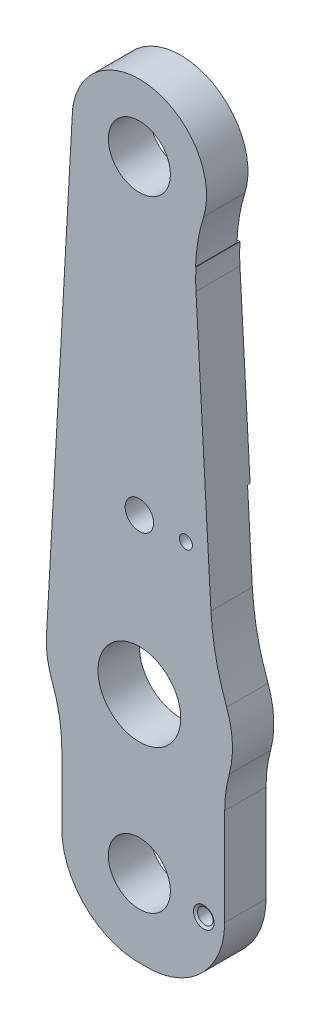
ISO-10303-21;
HEADER;
FILE_DESCRIPTION(('STEP AP214'),'2;1');
FILE_NAME('part.step','',(''),(''),'','','');
FILE_SCHEMA(('AUTOMOTIVE_DESIGN { 1 0 10303 214 1 1 1 1 }'));
ENDSEC;
DATA;
#1=APPLICATION_CONTEXT('core data for automotive mechanical design processes');
#2=APPLICATION_PROTOCOL_DEFINITION('international standard','automotive_design',2000,#1);
#3=PRODUCT_CONTEXT('',#1,'mechanical');
#4=PRODUCT('Part','Part','',(#3));
#5=PRODUCT_RELATED_PRODUCT_CATEGORY('part','',(#4));
#6=PRODUCT_DEFINITION_FORMATION('','',#4);
#7=PRODUCT_DEFINITION_CONTEXT('part definition',#1,'design');
#8=PRODUCT_DEFINITION('design','',#6,#7);
#9=PRODUCT_DEFINITION_SHAPE('','',#8);
#10=(LENGTH_UNIT() NAMED_UNIT(*) SI_UNIT(.MILLI.,.METRE.));
#11=(NAMED_UNIT(*) PLANE_ANGLE_UNIT() SI_UNIT($,.RADIAN.));
#12=(NAMED_UNIT(*) SI_UNIT($,.STERADIAN.) SOLID_ANGLE_UNIT());
#13=UNCERTAINTY_MEASURE_WITH_UNIT(LENGTH_MEASURE(1.E-05),#10,'distance_accuracy_value','');
#14=(GEOMETRIC_REPRESENTATION_CONTEXT(3) GLOBAL_UNCERTAINTY_ASSIGNED_CONTEXT((#13)) GLOBAL_UNIT_ASSIGNED_CONTEXT((#10,
#11,#12)) REPRESENTATION_CONTEXT('',''));
#15=CARTESIAN_POINT('',(0.,0.,0.));
#16=DIRECTION('',(0.,0.,1.));
#17=DIRECTION('',(1.,0.,0.));
#18=AXIS2_PLACEMENT_3D('',#15,#16,#17);
#19=CARTESIAN_POINT('',(0.,-180.,0.));
#20=DIRECTION('',(0.,0.,1.));
#21=DIRECTION('',(1.,0.,0.));
#22=AXIS2_PLACEMENT_3D('',#19,#20,#21);
#23=PLANE('',#22);
#24=CARTESIAN_POINT('',(18.,-120.,0.));
#25=DIRECTION('',(0.,0.,1.));
#26=DIRECTION('',(1.,0.,0.));
#27=AXIS2_PLACEMENT_3D('',#24,#25,#26);
#28=CIRCLE('',#27,2.5);
#29=CARTESIAN_POINT('',(20.5,-120.,0.));
#30=VERTEX_POINT('',#29);
#31=EDGE_CURVE('E421',#30,#30,#28,.T.);
#32=ORIENTED_EDGE('',*,*,#31,.T.);
#33=EDGE_LOOP('',(#32));
#34=FACE_BOUND('',#33,.T.);
#35=CARTESIAN_POINT('',(0.,-180.,0.));
#36=DIRECTION('',(0.,0.,1.));
#37=DIRECTION('',(1.,0.,0.));
#38=AXIS2_PLACEMENT_3D('',#35,#36,#37);
#39=CIRCLE('',#38,16.);
#40=CARTESIAN_POINT('',(16.,-180.,0.));
#41=VERTEX_POINT('',#40);
#42=EDGE_CURVE('E416',#41,#41,#39,.T.);
#43=ORIENTED_EDGE('',*,*,#42,.T.);
#44=EDGE_LOOP('',(#43));
#45=FACE_BOUND('',#44,.T.);
#46=CARTESIAN_POINT('',(0.,-120.,0.));
#47=DIRECTION('',(0.,0.,1.));
#48=DIRECTION('',(1.,0.,0.));
#49=AXIS2_PLACEMENT_3D('',#46,#47,#48);
#50=CIRCLE('',#49,5.5);
#51=CARTESIAN_POINT('',(5.5,-120.,0.));
#52=VERTEX_POINT('',#51);
#53=EDGE_CURVE('E373',#52,#52,#50,.T.);
#54=ORIENTED_EDGE('',*,*,#53,.T.);
#55=EDGE_LOOP('',(#54));
#56=FACE_BOUND('',#55,.T.);
#57=CARTESIAN_POINT('',(0.,-240.,0.));
#58=DIRECTION('',(0.,0.,1.));
#59=DIRECTION('',(1.,0.,0.));
#60=AXIS2_PLACEMENT_3D('',#57,#58,#59);
#61=CIRCLE('',#60,12.);
#62=CARTESIAN_POINT('',(12.,-240.,0.));
#63=VERTEX_POINT('',#62);
#64=EDGE_CURVE('E218',#63,#63,#61,.T.);
#65=ORIENTED_EDGE('',*,*,#64,.T.);
#66=EDGE_LOOP('',(#65));
#67=FACE_BOUND('',#66,.T.);
#68=DIRECTION('',(-0.0554700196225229,-0.998460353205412,0.));
#69=VECTOR('',#68,1.);
#70=CARTESIAN_POINT('',(-26.,0.,0.));
#71=LINE('',#70,#69);
#72=CARTESIAN_POINT('',(-31.8333333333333,-105.,0.));
#73=VERTEX_POINT('',#72);
#74=CARTESIAN_POINT('',(-35.7784615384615,-176.012307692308,0.));
#75=VERTEX_POINT('',#74);
#76=EDGE_CURVE('E247',#73,#75,#71,.T.);
#77=ORIENTED_EDGE('',*,*,#76,.F.);
#78=DIRECTION('',(1.,0.,0.));
#79=VECTOR('',#78,1.);
#80=CARTESIAN_POINT('',(0.,-105.,0.));
#81=LINE('',#80,#79);
#82=CARTESIAN_POINT('',(25.8333333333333,-105.,0.));
#83=VERTEX_POINT('',#82);
#84=EDGE_CURVE('E370',#73,#83,#81,.T.);
#85=ORIENTED_EDGE('',*,*,#84,.T.);
#86=DIRECTION('',(-0.0554700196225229,0.998460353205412,0.));
#87=VECTOR('',#86,1.);
#88=CARTESIAN_POINT('',(21.7961207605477,-32.3301736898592,0.));
#89=LINE('',#88,#87);
#90=CARTESIAN_POINT('',(27.6833465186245,-138.30023733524,0.));
#91=VERTEX_POINT('',#90);
#92=EDGE_CURVE('E240',#91,#83,#89,.T.);
#93=ORIENTED_EDGE('',*,*,#92,.F.);
#94=CARTESIAN_POINT('',(127.529381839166,-132.753235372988,0.));
#95=DIRECTION('',(0.,0.,-1.));
#96=DIRECTION('',(1.,0.,0.));
#97=AXIS2_PLACEMENT_3D('',#94,#95,#96);
#98=CIRCLE('',#97,100.);
#99=CARTESIAN_POINT('',(33.7577775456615,-167.493503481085,0.));
#100=VERTEX_POINT('',#99);
#101=EDGE_CURVE('E238',#100,#91,#98,.T.);
#102=ORIENTED_EDGE('',*,*,#101,.F.);
#103=CARTESIAN_POINT('',(0.,-180.,0.));
#104=DIRECTION('',(0.,0.,1.));
#105=DIRECTION('',(1.,0.,0.));
#106=AXIS2_PLACEMENT_3D('',#103,#104,#105);
#107=CIRCLE('',#106,36.);
#108=CARTESIAN_POINT('',(34.7441860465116,-189.425578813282,0.));
#109=VERTEX_POINT('',#108);
#110=EDGE_CURVE('E236',#109,#100,#107,.T.);
#111=ORIENTED_EDGE('',*,*,#110,.F.);
#112=CARTESIAN_POINT('',(83.,-202.516660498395,0.));
#113=DIRECTION('',(0.,0.,-1.));
#114=DIRECTION('',(-1.,0.,0.));
#115=AXIS2_PLACEMENT_3D('',#112,#113,#114);
#116=CIRCLE('',#115,50.);
#117=CARTESIAN_POINT('',(33.,-202.516660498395,0.));
#118=VERTEX_POINT('',#117);
#119=EDGE_CURVE('E234',#118,#109,#116,.T.);
#120=ORIENTED_EDGE('',*,*,#119,.F.);
#121=DIRECTION('',(0.,1.,0.));
#122=VECTOR('',#121,1.);
#123=CARTESIAN_POINT('',(33.,-240.,0.));
#124=LINE('',#123,#122);
#125=CARTESIAN_POINT('',(33.,-240.,0.));
#126=VERTEX_POINT('',#125);
#127=EDGE_CURVE('E232',#126,#118,#124,.T.);
#128=ORIENTED_EDGE('',*,*,#127,.F.);
#129=CARTESIAN_POINT('',(3.00000000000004,-240.,0.));
#130=DIRECTION('',(0.,0.,1.));
#131=DIRECTION('',(1.,0.,0.));
#132=AXIS2_PLACEMENT_3D('',#129,#130,#131);
#133=CIRCLE('',#132,30.);
#134=CARTESIAN_POINT('',(1.50000000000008,-269.962476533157,0.));
#135=VERTEX_POINT('',#134);
#136=EDGE_CURVE('E230',#135,#126,#133,.T.);
#137=ORIENTED_EDGE('',*,*,#136,.F.);
#138=CARTESIAN_POINT('',(0.,-240.,0.));
#139=DIRECTION('',(0.,0.,1.));
#140=DIRECTION('',(1.,0.,0.));
#141=AXIS2_PLACEMENT_3D('',#138,#139,#140);
#142=CIRCLE('',#141,29.9999999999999);
#143=CARTESIAN_POINT('',(-29.9999999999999,-240.,0.));
#144=VERTEX_POINT('',#143);
#145=EDGE_CURVE('E228',#144,#135,#142,.T.);
#146=ORIENTED_EDGE('',*,*,#145,.F.);
#147=DIRECTION('',(0.,-1.,0.));
#148=VECTOR('',#147,1.);
#149=CARTESIAN_POINT('',(-30.,-240.,0.));
#150=LINE('',#149,#148);
#151=CARTESIAN_POINT('',(-30.,-213.40658617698,0.));
#152=VERTEX_POINT('',#151);
#153=EDGE_CURVE('E226',#152,#144,#150,.T.);
#154=ORIENTED_EDGE('',*,*,#153,.F.);
#155=CARTESIAN_POINT('',(-90.,-213.40658617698,0.));
#156=DIRECTION('',(0.,0.,-1.));
#157=DIRECTION('',(-1.,0.,0.));
#158=AXIS2_PLACEMENT_3D('',#155,#156,#157);
#159=CIRCLE('',#158,60.);
#160=CARTESIAN_POINT('',(-33.75,-192.527469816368,0.));
#161=VERTEX_POINT('',#160);
#162=EDGE_CURVE('E224',#161,#152,#159,.T.);
#163=ORIENTED_EDGE('',*,*,#162,.F.);
#164=CARTESIAN_POINT('',(0.,-180.,0.));
#165=DIRECTION('',(0.,0.,1.));
#166=DIRECTION('',(1.,0.,0.));
#167=AXIS2_PLACEMENT_3D('',#164,#165,#166);
#168=CIRCLE('',#167,36.);
#169=EDGE_CURVE('E215',#75,#161,#168,.T.);
#170=ORIENTED_EDGE('',*,*,#169,.F.);
#171=EDGE_LOOP('',(#77,#85,#93,#102,#111,#120,#128,#137,#146,#154,#163,#170));
#172=FACE_BOUND('',#171,.T.);
#173=ADVANCED_FACE('F34',(#34,#45,#56,#67,#172),#23,.F.);
#174=CARTESIAN_POINT('',(0.,-180.,16.));
#175=DIRECTION('',(0.,0.,1.));
#176=DIRECTION('',(1.,0.,0.));
#177=AXIS2_PLACEMENT_3D('',#174,#175,#176);
#178=PLANE('',#177);
#179=CARTESIAN_POINT('',(18.,-120.,16.));
#180=DIRECTION('',(0.,0.,1.));
#181=DIRECTION('',(1.,0.,0.));
#182=AXIS2_PLACEMENT_3D('',#179,#180,#181);
#183=CIRCLE('',#182,2.5);
#184=CARTESIAN_POINT('',(20.5,-120.,16.));
#185=VERTEX_POINT('',#184);
#186=EDGE_CURVE('E425',#185,#185,#183,.T.);
#187=ORIENTED_EDGE('',*,*,#186,.F.);
#188=EDGE_LOOP('',(#187));
#189=FACE_BOUND('',#188,.T.);
#190=CARTESIAN_POINT('',(0.,-180.,16.));
#191=DIRECTION('',(0.,0.,1.));
#192=DIRECTION('',(1.,0.,0.));
#193=AXIS2_PLACEMENT_3D('',#190,#191,#192);
#194=CIRCLE('',#193,16.);
#195=CARTESIAN_POINT('',(16.,-180.,16.));
#196=VERTEX_POINT('',#195);
#197=EDGE_CURVE('E418',#196,#196,#194,.T.);
#198=ORIENTED_EDGE('',*,*,#197,.F.);
#199=EDGE_LOOP('',(#198));
#200=FACE_BOUND('',#199,.T.);
#201=CARTESIAN_POINT('',(24.9048674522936,-242.178893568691,16.));
#202=DIRECTION('',(0.,0.,1.));
#203=DIRECTION('',(1.,0.,0.));
#204=AXIS2_PLACEMENT_3D('',#201,#202,#203);
#205=CIRCLE('',#204,4.00000000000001);
#206=CARTESIAN_POINT('',(28.9048674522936,-242.178893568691,16.));
#207=VERTEX_POINT('',#206);
#208=EDGE_CURVE('E11',#207,#207,#205,.F.);
#209=ORIENTED_EDGE('',*,*,#208,.T.);
#210=EDGE_LOOP('',(#209));
#211=FACE_BOUND('',#210,.T.);
#212=DIRECTION('',(-0.0554700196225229,-0.998460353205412,0.));
#213=VECTOR('',#212,1.);
#214=CARTESIAN_POINT('',(-26.,0.,16.));
#215=LINE('',#214,#213);
#216=CARTESIAN_POINT('',(-26.,0.,16.));
#217=VERTEX_POINT('',#216);
#218=CARTESIAN_POINT('',(-35.7784615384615,-176.012307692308,16.));
#219=VERTEX_POINT('',#218);
#220=EDGE_CURVE('E277',#217,#219,#215,.T.);
#221=ORIENTED_EDGE('',*,*,#220,.T.);
#222=CARTESIAN_POINT('',(0.,-180.,16.));
#223=DIRECTION('',(0.,0.,1.));
#224=DIRECTION('',(1.,0.,0.));
#225=AXIS2_PLACEMENT_3D('',#222,#223,#224);
#226=CIRCLE('',#225,36.);
#227=CARTESIAN_POINT('',(-33.75,-192.527469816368,16.));
#228=VERTEX_POINT('',#227);
#229=EDGE_CURVE('E251',#219,#228,#226,.T.);
#230=ORIENTED_EDGE('',*,*,#229,.T.);
#231=CARTESIAN_POINT('',(-90.,-213.40658617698,16.));
#232=DIRECTION('',(0.,0.,-1.));
#233=DIRECTION('',(-1.,0.,0.));
#234=AXIS2_PLACEMENT_3D('',#231,#232,#233);
#235=CIRCLE('',#234,60.);
#236=CARTESIAN_POINT('',(-30.,-213.40658617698,16.));
#237=VERTEX_POINT('',#236);
#238=EDGE_CURVE('E254',#228,#237,#235,.T.);
#239=ORIENTED_EDGE('',*,*,#238,.T.);
#240=DIRECTION('',(0.,-1.,0.));
#241=VECTOR('',#240,1.);
#242=CARTESIAN_POINT('',(-30.,-240.,16.));
#243=LINE('',#242,#241);
#244=CARTESIAN_POINT('',(-29.9999999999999,-240.,16.));
#245=VERTEX_POINT('',#244);
#246=EDGE_CURVE('E256',#237,#245,#243,.T.);
#247=ORIENTED_EDGE('',*,*,#246,.T.);
#248=CARTESIAN_POINT('',(0.,-240.,16.));
#249=DIRECTION('',(0.,0.,1.));
#250=DIRECTION('',(1.,0.,0.));
#251=AXIS2_PLACEMENT_3D('',#248,#249,#250);
#252=CIRCLE('',#251,29.9999999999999);
#253=CARTESIAN_POINT('',(1.50000000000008,-269.962476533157,16.));
#254=VERTEX_POINT('',#253);
#255=EDGE_CURVE('E258',#245,#254,#252,.T.);
#256=ORIENTED_EDGE('',*,*,#255,.T.);
#257=CARTESIAN_POINT('',(3.00000000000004,-240.,16.));
#258=DIRECTION('',(0.,0.,1.));
#259=DIRECTION('',(1.,0.,0.));
#260=AXIS2_PLACEMENT_3D('',#257,#258,#259);
#261=CIRCLE('',#260,30.);
#262=CARTESIAN_POINT('',(33.,-240.,16.));
#263=VERTEX_POINT('',#262);
#264=EDGE_CURVE('E260',#254,#263,#261,.T.);
#265=ORIENTED_EDGE('',*,*,#264,.T.);
#266=DIRECTION('',(0.,1.,0.));
#267=VECTOR('',#266,1.);
#268=CARTESIAN_POINT('',(33.,-240.,16.));
#269=LINE('',#268,#267);
#270=CARTESIAN_POINT('',(33.,-202.516660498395,16.));
#271=VERTEX_POINT('',#270);
#272=EDGE_CURVE('E262',#263,#271,#269,.T.);
#273=ORIENTED_EDGE('',*,*,#272,.T.);
#274=CARTESIAN_POINT('',(83.,-202.516660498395,16.));
#275=DIRECTION('',(0.,0.,-1.));
#276=DIRECTION('',(-1.,0.,0.));
#277=AXIS2_PLACEMENT_3D('',#274,#275,#276);
#278=CIRCLE('',#277,50.);
#279=CARTESIAN_POINT('',(34.7441860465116,-189.425578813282,16.));
#280=VERTEX_POINT('',#279);
#281=EDGE_CURVE('E264',#271,#280,#278,.T.);
#282=ORIENTED_EDGE('',*,*,#281,.T.);
#283=CARTESIAN_POINT('',(0.,-180.,16.));
#284=DIRECTION('',(0.,0.,1.));
#285=DIRECTION('',(1.,0.,0.));
#286=AXIS2_PLACEMENT_3D('',#283,#284,#285);
#287=CIRCLE('',#286,36.);
#288=CARTESIAN_POINT('',(33.7577775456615,-167.493503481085,16.));
#289=VERTEX_POINT('',#288);
#290=EDGE_CURVE('E266',#280,#289,#287,.T.);
#291=ORIENTED_EDGE('',*,*,#290,.T.);
#292=CARTESIAN_POINT('',(127.529381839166,-132.753235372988,16.));
#293=DIRECTION('',(0.,0.,-1.));
#294=DIRECTION('',(1.,0.,0.));
#295=AXIS2_PLACEMENT_3D('',#292,#293,#294);
#296=CIRCLE('',#295,100.);
#297=CARTESIAN_POINT('',(27.6833465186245,-138.30023733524,16.));
#298=VERTEX_POINT('',#297);
#299=EDGE_CURVE('E268',#289,#298,#296,.T.);
#300=ORIENTED_EDGE('',*,*,#299,.T.);
#301=DIRECTION('',(-0.0554700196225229,0.998460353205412,0.));
#302=VECTOR('',#301,1.);
#303=CARTESIAN_POINT('',(21.7961207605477,-32.3301736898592,16.));
#304=LINE('',#303,#302);
#305=CARTESIAN_POINT('',(21.8964840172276,-34.1367123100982,16.));
#306=VERTEX_POINT('',#305);
#307=EDGE_CURVE('E270',#298,#306,#304,.T.);
#308=ORIENTED_EDGE('',*,*,#307,.T.);
#309=CARTESIAN_POINT('',(91.7887087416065,-30.2538109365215,16.));
#310=DIRECTION('',(0.,0.,-1.));
#311=DIRECTION('',(-1.,0.,0.));
#312=AXIS2_PLACEMENT_3D('',#309,#310,#311);
#313=CIRCLE('',#312,70.);
#314=CARTESIAN_POINT('',(21.9180776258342,-26.,16.));
#315=VERTEX_POINT('',#314);
#316=EDGE_CURVE('E334',#306,#315,#313,.T.);
#317=ORIENTED_EDGE('',*,*,#316,.T.);
#318=DIRECTION('',(-1.,0.,0.));
#319=VECTOR('',#318,1.);
#320=CARTESIAN_POINT('',(-27.4444444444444,-26.,16.));
#321=LINE('',#320,#319);
#322=CARTESIAN_POINT('',(21.7311381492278,-26.,16.));
#323=VERTEX_POINT('',#322);
#324=EDGE_CURVE('E56',#315,#323,#321,.T.);
#325=ORIENTED_EDGE('',*,*,#324,.T.);
#326=CARTESIAN_POINT('',(91.6883454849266,-28.4472723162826,16.));
#327=DIRECTION('',(0.,0.,-1.));
#328=DIRECTION('',(-1.,0.,0.));
#329=AXIS2_PLACEMENT_3D('',#326,#327,#328);
#330=CIRCLE('',#329,70.);
#331=CARTESIAN_POINT('',(24.832260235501,-7.70446958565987,16.));
#332=VERTEX_POINT('',#331);
#333=EDGE_CURVE('E272',#323,#332,#330,.T.);
#334=ORIENTED_EDGE('',*,*,#333,.T.);
#335=CARTESIAN_POINT('',(0.,0.,16.));
#336=DIRECTION('',(0.,0.,1.));
#337=DIRECTION('',(1.,0.,0.));
#338=AXIS2_PLACEMENT_3D('',#335,#336,#337);
#339=CIRCLE('',#338,26.);
#340=EDGE_CURVE('E274',#332,#217,#339,.T.);
#341=ORIENTED_EDGE('',*,*,#340,.T.);
#342=EDGE_LOOP('',(#221,#230,#239,#247,#256,#265,#273,#282,#291,#300,#308,#317,#325,#334,#341));
#343=FACE_BOUND('',#342,.T.);
#344=CARTESIAN_POINT('',(0.,0.,16.));
#345=DIRECTION('',(0.,0.,1.));
#346=DIRECTION('',(1.,0.,0.));
#347=AXIS2_PLACEMENT_3D('',#344,#345,#346);
#348=CIRCLE('',#347,12.);
#349=CARTESIAN_POINT('',(12.,0.,16.));
#350=VERTEX_POINT('',#349);
#351=EDGE_CURVE('E211',#350,#350,#348,.T.);
#352=ORIENTED_EDGE('',*,*,#351,.F.);
#353=EDGE_LOOP('',(#352));
#354=FACE_BOUND('',#353,.T.);
#355=CARTESIAN_POINT('',(0.,-120.,16.));
#356=DIRECTION('',(0.,0.,1.));
#357=DIRECTION('',(1.,0.,0.));
#358=AXIS2_PLACEMENT_3D('',#355,#356,#357);
#359=CIRCLE('',#358,5.5);
#360=CARTESIAN_POINT('',(5.5,-120.,16.));
#361=VERTEX_POINT('',#360);
#362=EDGE_CURVE('E376',#361,#361,#359,.T.);
#363=ORIENTED_EDGE('',*,*,#362,.F.);
#364=EDGE_LOOP('',(#363));
#365=FACE_BOUND('',#364,.T.);
#366=CARTESIAN_POINT('',(0.,-240.,16.));
#367=DIRECTION('',(0.,0.,1.));
#368=DIRECTION('',(1.,0.,0.));
#369=AXIS2_PLACEMENT_3D('',#366,#367,#368);
#370=CIRCLE('',#369,12.);
#371=CARTESIAN_POINT('',(12.,-240.,16.));
#372=VERTEX_POINT('',#371);
#373=EDGE_CURVE('E212',#372,#372,#370,.T.);
#374=ORIENTED_EDGE('',*,*,#373,.F.);
#375=EDGE_LOOP('',(#374));
#376=FACE_BOUND('',#375,.T.);
#377=ADVANCED_FACE('F183',(#189,#200,#211,#343,#354,#365,#376),#178,.T.);
#378=CARTESIAN_POINT('',(91.6883454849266,-28.4472723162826,0.));
#379=DIRECTION('',(0.,0.,-1.));
#380=DIRECTION('',(-1.,0.,0.));
#381=AXIS2_PLACEMENT_3D('',#378,#379,#380);
#382=CIRCLE('',#381,70.);
#383=CARTESIAN_POINT('',(21.7311381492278,-26.,0.));
#384=VERTEX_POINT('',#383);
#385=CARTESIAN_POINT('',(24.832260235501,-7.70446958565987,0.));
#386=VERTEX_POINT('',#385);
#387=EDGE_CURVE('E206',#384,#386,#382,.T.);
#388=ORIENTED_EDGE('',*,*,#387,.F.);
#389=DIRECTION('',(-1.,0.,0.));
#390=VECTOR('',#389,1.);
#391=CARTESIAN_POINT('',(0.,-26.,0.));
#392=LINE('',#391,#390);
#393=CARTESIAN_POINT('',(-27.4444444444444,-26.,0.));
#394=VERTEX_POINT('',#393);
#395=EDGE_CURVE('E368',#384,#394,#392,.T.);
#396=ORIENTED_EDGE('',*,*,#395,.T.);
#397=CARTESIAN_POINT('',(-26.,0.,0.));
#398=VERTEX_POINT('',#397);
#399=EDGE_CURVE('E248',#398,#394,#71,.T.);
#400=ORIENTED_EDGE('',*,*,#399,.F.);
#401=CARTESIAN_POINT('',(0.,0.,0.));
#402=DIRECTION('',(0.,0.,1.));
#403=DIRECTION('',(1.,0.,0.));
#404=AXIS2_PLACEMENT_3D('',#401,#402,#403);
#405=CIRCLE('',#404,26.);
#406=EDGE_CURVE('E244',#386,#398,#405,.T.);
#407=ORIENTED_EDGE('',*,*,#406,.F.);
#408=EDGE_LOOP('',(#388,#396,#400,#407));
#409=FACE_BOUND('',#408,.T.);
#410=CARTESIAN_POINT('',(0.,0.,0.));
#411=DIRECTION('',(0.,0.,1.));
#412=DIRECTION('',(1.,0.,0.));
#413=AXIS2_PLACEMENT_3D('',#410,#411,#412);
#414=CIRCLE('',#413,12.);
#415=CARTESIAN_POINT('',(12.,0.,0.));
#416=VERTEX_POINT('',#415);
#417=EDGE_CURVE('E209',#416,#416,#414,.T.);
#418=ORIENTED_EDGE('',*,*,#417,.T.);
#419=EDGE_LOOP('',(#418));
#420=FACE_BOUND('',#419,.T.);
#421=ADVANCED_FACE('F186',(#409,#420),#23,.F.);
#422=CARTESIAN_POINT('',(0.,-180.,16.));
#423=DIRECTION('',(0.,0.,-1.));
#424=DIRECTION('',(-1.,0.,0.));
#425=AXIS2_PLACEMENT_3D('',#422,#423,#424);
#426=CYLINDRICAL_SURFACE('',#425,36.);
#427=ORIENTED_EDGE('',*,*,#169,.T.);
#428=DIRECTION('',(0.,0.,-1.));
#429=VECTOR('',#428,1.);
#430=CARTESIAN_POINT('',(-33.75,-192.527469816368,16.));
#431=LINE('',#430,#429);
#432=EDGE_CURVE('E312',#228,#161,#431,.T.);
#433=ORIENTED_EDGE('',*,*,#432,.F.);
#434=ORIENTED_EDGE('',*,*,#229,.F.);
#435=DIRECTION('',(0.,0.,-1.));
#436=VECTOR('',#435,1.);
#437=CARTESIAN_POINT('',(-35.7784615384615,-176.012307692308,16.));
#438=LINE('',#437,#436);
#439=EDGE_CURVE('E279',#219,#75,#438,.T.);
#440=ORIENTED_EDGE('',*,*,#439,.T.);
#441=EDGE_LOOP('',(#427,#433,#434,#440));
#442=FACE_BOUND('',#441,.T.);
#443=ADVANCED_FACE('F36',(#442),#426,.T.);
#444=CARTESIAN_POINT('',(-90.,-213.40658617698,16.));
#445=DIRECTION('',(0.,0.,-1.));
#446=DIRECTION('',(-1.,0.,0.));
#447=AXIS2_PLACEMENT_3D('',#444,#445,#446);
#448=CYLINDRICAL_SURFACE('',#447,60.);
#449=ORIENTED_EDGE('',*,*,#162,.T.);
#450=DIRECTION('',(0.,0.,-1.));
#451=VECTOR('',#450,1.);
#452=CARTESIAN_POINT('',(-30.,-213.40658617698,16.));
#453=LINE('',#452,#451);
#454=EDGE_CURVE('E309',#237,#152,#453,.T.);
#455=ORIENTED_EDGE('',*,*,#454,.F.);
#456=ORIENTED_EDGE('',*,*,#238,.F.);
#457=ORIENTED_EDGE('',*,*,#432,.T.);
#458=EDGE_LOOP('',(#449,#455,#456,#457));
#459=FACE_BOUND('',#458,.T.);
#460=ADVANCED_FACE('F200',(#459),#448,.F.);
#461=CARTESIAN_POINT('',(-30.,-240.,16.));
#462=DIRECTION('',(1.,0.,0.));
#463=DIRECTION('',(0.,0.,-1.));
#464=AXIS2_PLACEMENT_3D('',#461,#462,#463);
#465=PLANE('',#464);
#466=ORIENTED_EDGE('',*,*,#153,.T.);
#467=DIRECTION('',(0.,0.,-1.));
#468=VECTOR('',#467,1.);
#469=CARTESIAN_POINT('',(-29.9999999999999,-240.,16.));
#470=LINE('',#469,#468);
#471=EDGE_CURVE('E306',#245,#144,#470,.T.);
#472=ORIENTED_EDGE('',*,*,#471,.F.);
#473=ORIENTED_EDGE('',*,*,#246,.F.);
#474=ORIENTED_EDGE('',*,*,#454,.T.);
#475=EDGE_LOOP('',(#466,#472,#473,#474));
#476=FACE_BOUND('',#475,.T.);
#477=ADVANCED_FACE('F460',(#476),#465,.F.);
#478=CARTESIAN_POINT('',(0.,-240.,16.));
#479=DIRECTION('',(0.,0.,-1.));
#480=DIRECTION('',(-1.,0.,0.));
#481=AXIS2_PLACEMENT_3D('',#478,#479,#480);
#482=CYLINDRICAL_SURFACE('',#481,29.9999999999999);
#483=ORIENTED_EDGE('',*,*,#145,.T.);
#484=DIRECTION('',(0.,0.,-1.));
#485=VECTOR('',#484,1.);
#486=CARTESIAN_POINT('',(1.50000000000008,-269.962476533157,16.));
#487=LINE('',#486,#485);
#488=EDGE_CURVE('E303',#254,#135,#487,.T.);
#489=ORIENTED_EDGE('',*,*,#488,.F.);
#490=ORIENTED_EDGE('',*,*,#255,.F.);
#491=ORIENTED_EDGE('',*,*,#471,.T.);
#492=EDGE_LOOP('',(#483,#489,#490,#491));
#493=FACE_BOUND('',#492,.T.);
#494=ADVANCED_FACE('F464',(#493),#482,.T.);
#495=CARTESIAN_POINT('',(3.00000000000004,-240.,16.));
#496=DIRECTION('',(0.,0.,-1.));
#497=DIRECTION('',(-1.,0.,0.));
#498=AXIS2_PLACEMENT_3D('',#495,#496,#497);
#499=CYLINDRICAL_SURFACE('',#498,30.);
#500=ORIENTED_EDGE('',*,*,#136,.T.);
#501=DIRECTION('',(0.,0.,-1.));
#502=VECTOR('',#501,1.);
#503=CARTESIAN_POINT('',(33.,-240.,16.));
#504=LINE('',#503,#502);
#505=EDGE_CURVE('E300',#263,#126,#504,.T.);
#506=ORIENTED_EDGE('',*,*,#505,.F.);
#507=ORIENTED_EDGE('',*,*,#264,.F.);
#508=ORIENTED_EDGE('',*,*,#488,.T.);
#509=EDGE_LOOP('',(#500,#506,#507,#508));
#510=FACE_BOUND('',#509,.T.);
#511=ADVANCED_FACE('F469',(#510),#499,.T.);
#512=CARTESIAN_POINT('',(33.,-240.,16.));
#513=DIRECTION('',(-1.,0.,0.));
#514=DIRECTION('',(0.,-1.,0.));
#515=AXIS2_PLACEMENT_3D('',#512,#513,#514);
#516=PLANE('',#515);
#517=ORIENTED_EDGE('',*,*,#127,.T.);
#518=DIRECTION('',(0.,0.,-1.));
#519=VECTOR('',#518,1.);
#520=CARTESIAN_POINT('',(33.,-202.516660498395,16.));
#521=LINE('',#520,#519);
#522=EDGE_CURVE('E297',#271,#118,#521,.T.);
#523=ORIENTED_EDGE('',*,*,#522,.F.);
#524=ORIENTED_EDGE('',*,*,#272,.F.);
#525=ORIENTED_EDGE('',*,*,#505,.T.);
#526=EDGE_LOOP('',(#517,#523,#524,#525));
#527=FACE_BOUND('',#526,.T.);
#528=ADVANCED_FACE('F475',(#527),#516,.F.);
#529=CARTESIAN_POINT('',(83.,-202.516660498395,16.));
#530=DIRECTION('',(0.,0.,-1.));
#531=DIRECTION('',(-1.,0.,0.));
#532=AXIS2_PLACEMENT_3D('',#529,#530,#531);
#533=CYLINDRICAL_SURFACE('',#532,50.);
#534=ORIENTED_EDGE('',*,*,#119,.T.);
#535=DIRECTION('',(0.,0.,-1.));
#536=VECTOR('',#535,1.);
#537=CARTESIAN_POINT('',(34.7441860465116,-189.425578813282,16.));
#538=LINE('',#537,#536);
#539=EDGE_CURVE('E294',#280,#109,#538,.T.);
#540=ORIENTED_EDGE('',*,*,#539,.F.);
#541=ORIENTED_EDGE('',*,*,#281,.F.);
#542=ORIENTED_EDGE('',*,*,#522,.T.);
#543=EDGE_LOOP('',(#534,#540,#541,#542));
#544=FACE_BOUND('',#543,.T.);
#545=ADVANCED_FACE('F479',(#544),#533,.F.);
#546=CARTESIAN_POINT('',(0.,-180.,16.));
#547=DIRECTION('',(0.,0.,-1.));
#548=DIRECTION('',(-1.,0.,0.));
#549=AXIS2_PLACEMENT_3D('',#546,#547,#548);
#550=CYLINDRICAL_SURFACE('',#549,36.);
#551=ORIENTED_EDGE('',*,*,#110,.T.);
#552=DIRECTION('',(0.,0.,-1.));
#553=VECTOR('',#552,1.);
#554=CARTESIAN_POINT('',(33.7577775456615,-167.493503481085,16.));
#555=LINE('',#554,#553);
#556=EDGE_CURVE('E291',#289,#100,#555,.T.);
#557=ORIENTED_EDGE('',*,*,#556,.F.);
#558=ORIENTED_EDGE('',*,*,#290,.F.);
#559=ORIENTED_EDGE('',*,*,#539,.T.);
#560=EDGE_LOOP('',(#551,#557,#558,#559));
#561=FACE_BOUND('',#560,.T.);
#562=ADVANCED_FACE('F484',(#561),#550,.T.);
#563=CARTESIAN_POINT('',(127.529381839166,-132.753235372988,16.));
#564=DIRECTION('',(0.,0.,-1.));
#565=DIRECTION('',(-1.,0.,0.));
#566=AXIS2_PLACEMENT_3D('',#563,#564,#565);
#567=CYLINDRICAL_SURFACE('',#566,100.);
#568=ORIENTED_EDGE('',*,*,#101,.T.);
#569=DIRECTION('',(0.,0.,-1.));
#570=VECTOR('',#569,1.);
#571=CARTESIAN_POINT('',(27.6833465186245,-138.30023733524,16.));
#572=LINE('',#571,#570);
#573=EDGE_CURVE('E288',#298,#91,#572,.T.);
#574=ORIENTED_EDGE('',*,*,#573,.F.);
#575=ORIENTED_EDGE('',*,*,#299,.F.);
#576=ORIENTED_EDGE('',*,*,#556,.T.);
#577=EDGE_LOOP('',(#568,#574,#575,#576));
#578=FACE_BOUND('',#577,.T.);
#579=ADVANCED_FACE('F490',(#578),#567,.F.);
#580=CARTESIAN_POINT('',(21.7961207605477,-32.3301736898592,16.));
#581=DIRECTION('',(-0.998460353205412,-0.0554700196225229,0.));
#582=DIRECTION('',(0.0554700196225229,-0.998460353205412,0.));
#583=AXIS2_PLACEMENT_3D('',#580,#581,#582);
#584=PLANE('',#583);
#585=ORIENTED_EDGE('',*,*,#92,.T.);
#586=DIRECTION('',(0.,0.,1.));
#587=VECTOR('',#586,1.);
#588=CARTESIAN_POINT('',(25.8333333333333,-105.,-1.));
#589=LINE('',#588,#587);
#590=CARTESIAN_POINT('',(25.8333333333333,-105.,-1.));
#591=VERTEX_POINT('',#590);
#592=EDGE_CURVE('E357',#591,#83,#589,.T.);
#593=ORIENTED_EDGE('',*,*,#592,.F.);
#594=DIRECTION('',(-0.0554700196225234,0.998460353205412,0.));
#595=VECTOR('',#594,1.);
#596=CARTESIAN_POINT('',(21.8964840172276,-34.1367123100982,-1.));
#597=LINE('',#596,#595);
#598=CARTESIAN_POINT('',(21.8964840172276,-34.1367123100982,-1.));
#599=VERTEX_POINT('',#598);
#600=EDGE_CURVE('E353',#591,#599,#597,.T.);
#601=ORIENTED_EDGE('',*,*,#600,.T.);
#602=DIRECTION('',(0.,0.,1.));
#603=VECTOR('',#602,1.);
#604=CARTESIAN_POINT('',(21.8964840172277,-34.1367123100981,-1.));
#605=LINE('',#604,#603);
#606=EDGE_CURVE('E315',#306,#599,#605,.F.);
#607=ORIENTED_EDGE('',*,*,#606,.F.);
#608=ORIENTED_EDGE('',*,*,#307,.F.);
#609=ORIENTED_EDGE('',*,*,#573,.T.);
#610=EDGE_LOOP('',(#585,#593,#601,#607,#608,#609));
#611=FACE_BOUND('',#610,.T.);
#612=ADVANCED_FACE('F495',(#611),#584,.F.);
#613=CARTESIAN_POINT('',(91.6883454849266,-28.4472723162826,16.));
#614=DIRECTION('',(0.,0.,-1.));
#615=DIRECTION('',(-1.,0.,0.));
#616=AXIS2_PLACEMENT_3D('',#613,#614,#615);
#617=CYLINDRICAL_SURFACE('',#616,70.);
#618=ORIENTED_EDGE('',*,*,#333,.F.);
#619=DIRECTION('',(0.,0.,-1.));
#620=VECTOR('',#619,1.);
#621=CARTESIAN_POINT('',(21.7311381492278,-26.,16.));
#622=LINE('',#621,#620);
#623=EDGE_CURVE('E359',#323,#384,#622,.T.);
#624=ORIENTED_EDGE('',*,*,#623,.T.);
#625=ORIENTED_EDGE('',*,*,#387,.T.);
#626=DIRECTION('',(0.,0.,-1.));
#627=VECTOR('',#626,1.);
#628=CARTESIAN_POINT('',(24.832260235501,-7.70446958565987,16.));
#629=LINE('',#628,#627);
#630=EDGE_CURVE('E285',#332,#386,#629,.T.);
#631=ORIENTED_EDGE('',*,*,#630,.F.);
#632=EDGE_LOOP('',(#618,#624,#625,#631));
#633=FACE_BOUND('',#632,.T.);
#634=ADVANCED_FACE('F504',(#633),#617,.F.);
#635=CARTESIAN_POINT('',(0.,0.,16.));
#636=DIRECTION('',(0.,0.,-1.));
#637=DIRECTION('',(-1.,0.,0.));
#638=AXIS2_PLACEMENT_3D('',#635,#636,#637);
#639=CYLINDRICAL_SURFACE('',#638,26.);
#640=ORIENTED_EDGE('',*,*,#406,.T.);
#641=DIRECTION('',(0.,0.,-1.));
#642=VECTOR('',#641,1.);
#643=CARTESIAN_POINT('',(-26.,0.,16.));
#644=LINE('',#643,#642);
#645=EDGE_CURVE('E282',#217,#398,#644,.T.);
#646=ORIENTED_EDGE('',*,*,#645,.F.);
#647=ORIENTED_EDGE('',*,*,#340,.F.);
#648=ORIENTED_EDGE('',*,*,#630,.T.);
#649=EDGE_LOOP('',(#640,#646,#647,#648));
#650=FACE_BOUND('',#649,.T.);
#651=ADVANCED_FACE('F506',(#650),#639,.T.);
#652=CARTESIAN_POINT('',(-26.,0.,16.));
#653=DIRECTION('',(0.998460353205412,-0.0554700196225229,0.));
#654=DIRECTION('',(0.0554700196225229,0.998460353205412,0.));
#655=AXIS2_PLACEMENT_3D('',#652,#653,#654);
#656=PLANE('',#655);
#657=ORIENTED_EDGE('',*,*,#399,.T.);
#658=DIRECTION('',(0.,0.,1.));
#659=VECTOR('',#658,1.);
#660=CARTESIAN_POINT('',(-27.4444444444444,-26.,-1.));
#661=LINE('',#660,#659);
#662=CARTESIAN_POINT('',(-27.4444444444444,-26.,-1.));
#663=VERTEX_POINT('',#662);
#664=EDGE_CURVE('E363',#663,#394,#661,.T.);
#665=ORIENTED_EDGE('',*,*,#664,.F.);
#666=DIRECTION('',(-0.0554700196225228,-0.998460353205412,0.));
#667=VECTOR('',#666,1.);
#668=CARTESIAN_POINT('',(-27.4444444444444,-26.,-1.));
#669=LINE('',#668,#667);
#670=CARTESIAN_POINT('',(-31.8333333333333,-105.,-1.));
#671=VERTEX_POINT('',#670);
#672=EDGE_CURVE('E347',#663,#671,#669,.T.);
#673=ORIENTED_EDGE('',*,*,#672,.T.);
#674=DIRECTION('',(0.,0.,1.));
#675=VECTOR('',#674,1.);
#676=CARTESIAN_POINT('',(-31.8333333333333,-105.,-1.));
#677=LINE('',#676,#675);
#678=EDGE_CURVE('E360',#671,#73,#677,.T.);
#679=ORIENTED_EDGE('',*,*,#678,.T.);
#680=ORIENTED_EDGE('',*,*,#76,.T.);
#681=ORIENTED_EDGE('',*,*,#439,.F.);
#682=ORIENTED_EDGE('',*,*,#220,.F.);
#683=ORIENTED_EDGE('',*,*,#645,.T.);
#684=EDGE_LOOP('',(#657,#665,#673,#679,#680,#681,#682,#683));
#685=FACE_BOUND('',#684,.T.);
#686=ADVANCED_FACE('F396',(#685),#656,.F.);
#687=CARTESIAN_POINT('',(0.,0.,16.));
#688=DIRECTION('',(0.,0.,-1.));
#689=DIRECTION('',(-1.,0.,0.));
#690=AXIS2_PLACEMENT_3D('',#687,#688,#689);
#691=CYLINDRICAL_SURFACE('',#690,12.);
#692=ORIENTED_EDGE('',*,*,#351,.T.);
#693=EDGE_LOOP('',(#692));
#694=FACE_BOUND('',#693,.T.);
#695=ORIENTED_EDGE('',*,*,#417,.F.);
#696=EDGE_LOOP('',(#695));
#697=FACE_BOUND('',#696,.T.);
#698=ADVANCED_FACE('F386',(#694,#697),#691,.F.);
#699=CARTESIAN_POINT('',(0.,-240.,16.));
#700=DIRECTION('',(0.,0.,-1.));
#701=DIRECTION('',(-1.,0.,0.));
#702=AXIS2_PLACEMENT_3D('',#699,#700,#701);
#703=CYLINDRICAL_SURFACE('',#702,12.);
#704=ORIENTED_EDGE('',*,*,#373,.T.);
#705=EDGE_LOOP('',(#704));
#706=FACE_BOUND('',#705,.T.);
#707=ORIENTED_EDGE('',*,*,#64,.F.);
#708=EDGE_LOOP('',(#707));
#709=FACE_BOUND('',#708,.T.);
#710=ADVANCED_FACE('F383',(#706,#709),#703,.F.);
#711=CARTESIAN_POINT('',(0.,-120.,16.));
#712=DIRECTION('',(0.,0.,-1.));
#713=DIRECTION('',(-1.,0.,0.));
#714=AXIS2_PLACEMENT_3D('',#711,#712,#713);
#715=CYLINDRICAL_SURFACE('',#714,5.5);
#716=ORIENTED_EDGE('',*,*,#362,.T.);
#717=EDGE_LOOP('',(#716));
#718=FACE_BOUND('',#717,.T.);
#719=ORIENTED_EDGE('',*,*,#53,.F.);
#720=EDGE_LOOP('',(#719));
#721=FACE_BOUND('',#720,.T.);
#722=ADVANCED_FACE('F385',(#718,#721),#715,.F.);
#723=CARTESIAN_POINT('',(-31.8333333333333,-105.,-1.));
#724=DIRECTION('',(0.,-1.,0.));
#725=DIRECTION('',(0.,0.,-1.));
#726=AXIS2_PLACEMENT_3D('',#723,#724,#725);
#727=PLANE('',#726);
#728=ORIENTED_EDGE('',*,*,#84,.F.);
#729=ORIENTED_EDGE('',*,*,#678,.F.);
#730=DIRECTION('',(1.,0.,0.));
#731=VECTOR('',#730,1.);
#732=CARTESIAN_POINT('',(-31.8333333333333,-105.,-1.));
#733=LINE('',#732,#731);
#734=EDGE_CURVE('E350',#671,#591,#733,.T.);
#735=ORIENTED_EDGE('',*,*,#734,.T.);
#736=ORIENTED_EDGE('',*,*,#592,.T.);
#737=EDGE_LOOP('',(#728,#729,#735,#736));
#738=FACE_BOUND('',#737,.T.);
#739=ADVANCED_FACE('F393',(#738),#727,.T.);
#740=CARTESIAN_POINT('',(-27.4444444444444,-26.,-1.));
#741=DIRECTION('',(0.,1.,0.));
#742=DIRECTION('',(0.,0.,1.));
#743=AXIS2_PLACEMENT_3D('',#740,#741,#742);
#744=PLANE('',#743);
#745=ORIENTED_EDGE('',*,*,#395,.F.);
#746=ORIENTED_EDGE('',*,*,#623,.F.);
#747=ORIENTED_EDGE('',*,*,#324,.F.);
#748=DIRECTION('',(0.,0.,1.));
#749=VECTOR('',#748,1.);
#750=CARTESIAN_POINT('',(21.9180776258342,-26.,-1.));
#751=LINE('',#750,#749);
#752=CARTESIAN_POINT('',(21.9180776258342,-26.,-1.));
#753=VERTEX_POINT('',#752);
#754=EDGE_CURVE('E356',#753,#315,#751,.T.);
#755=ORIENTED_EDGE('',*,*,#754,.F.);
#756=DIRECTION('',(-1.,0.,0.));
#757=VECTOR('',#756,1.);
#758=CARTESIAN_POINT('',(-27.4444444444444,-26.,-1.));
#759=LINE('',#758,#757);
#760=EDGE_CURVE('E344',#753,#663,#759,.T.);
#761=ORIENTED_EDGE('',*,*,#760,.T.);
#762=ORIENTED_EDGE('',*,*,#664,.T.);
#763=EDGE_LOOP('',(#745,#746,#747,#755,#761,#762));
#764=FACE_BOUND('',#763,.T.);
#765=ADVANCED_FACE('F402',(#764),#744,.T.);
#766=CARTESIAN_POINT('',(91.7887087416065,-30.2538109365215,-1.));
#767=DIRECTION('',(0.,0.,1.));
#768=DIRECTION('',(1.,0.,0.));
#769=AXIS2_PLACEMENT_3D('',#766,#767,#768);
#770=CYLINDRICAL_SURFACE('',#769,70.);
#771=ORIENTED_EDGE('',*,*,#316,.F.);
#772=ORIENTED_EDGE('',*,*,#606,.T.);
#773=CARTESIAN_POINT('',(91.7887087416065,-30.2538109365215,-1.));
#774=DIRECTION('',(0.,0.,-1.));
#775=DIRECTION('',(-1.,0.,0.));
#776=AXIS2_PLACEMENT_3D('',#773,#774,#775);
#777=CIRCLE('',#776,70.);
#778=EDGE_CURVE('E341',#599,#753,#777,.T.);
#779=ORIENTED_EDGE('',*,*,#778,.T.);
#780=ORIENTED_EDGE('',*,*,#754,.T.);
#781=EDGE_LOOP('',(#771,#772,#779,#780));
#782=FACE_BOUND('',#781,.T.);
#783=ADVANCED_FACE('F399',(#782),#770,.F.);
#784=CARTESIAN_POINT('',(91.7887087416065,-30.2538109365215,-1.));
#785=DIRECTION('',(0.,0.,-1.));
#786=DIRECTION('',(-1.,0.,0.));
#787=AXIS2_PLACEMENT_3D('',#784,#785,#786);
#788=PLANE('',#787);
#789=ORIENTED_EDGE('',*,*,#778,.F.);
#790=ORIENTED_EDGE('',*,*,#600,.F.);
#791=ORIENTED_EDGE('',*,*,#734,.F.);
#792=ORIENTED_EDGE('',*,*,#672,.F.);
#793=ORIENTED_EDGE('',*,*,#760,.F.);
#794=EDGE_LOOP('',(#789,#790,#791,#792,#793));
#795=FACE_BOUND('',#794,.T.);
#796=ADVANCED_FACE('F325',(#795),#788,.T.);
#797=CARTESIAN_POINT('',(24.9048674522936,-242.178893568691,6.));
#798=DIRECTION('',(0.,0.,1.));
#799=DIRECTION('',(1.,0.,0.));
#800=AXIS2_PLACEMENT_3D('',#797,#798,#799);
#801=CYLINDRICAL_SURFACE('',#800,3.);
#802=CARTESIAN_POINT('',(24.9048674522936,-242.178893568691,15.4226497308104));
#803=DIRECTION('',(0.,0.,1.));
#804=DIRECTION('',(1.,0.,0.));
#805=AXIS2_PLACEMENT_3D('',#802,#803,#804);
#806=CIRCLE('',#805,3.);
#807=CARTESIAN_POINT('',(27.9048674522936,-242.178893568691,15.4226497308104));
#808=VERTEX_POINT('',#807);
#809=EDGE_CURVE('E42',#808,#808,#806,.T.);
#810=ORIENTED_EDGE('',*,*,#809,.T.);
#811=EDGE_LOOP('',(#810));
#812=FACE_BOUND('',#811,.T.);
#813=CARTESIAN_POINT('',(24.9048674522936,-242.178893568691,6.));
#814=DIRECTION('',(0.,0.,1.));
#815=DIRECTION('',(1.,0.,0.));
#816=AXIS2_PLACEMENT_3D('',#813,#814,#815);
#817=CIRCLE('',#816,3.);
#818=CARTESIAN_POINT('',(24.9524337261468,-239.179270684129,6.));
#819=VERTEX_POINT('',#818);
#820=CARTESIAN_POINT('',(24.9524337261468,-245.178516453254,6.));
#821=VERTEX_POINT('',#820);
#822=EDGE_CURVE('E330',#819,#821,#817,.T.);
#823=ORIENTED_EDGE('',*,*,#822,.F.);
#824=EDGE_CURVE('E331',#821,#819,#817,.T.);
#825=ORIENTED_EDGE('',*,*,#824,.F.);
#826=EDGE_LOOP('',(#823,#825));
#827=FACE_BOUND('',#826,.T.);
#828=ADVANCED_FACE('F321',(#812,#827),#801,.F.);
#829=CARTESIAN_POINT('',(24.9048674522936,-242.178893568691,6.));
#830=DIRECTION('',(0.,0.,1.));
#831=DIRECTION('',(1.,0.,0.));
#832=AXIS2_PLACEMENT_3D('',#829,#830,#831);
#833=PLANE('',#832);
#834=CARTESIAN_POINT('',(25.,-242.178893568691,6.));
#835=DIRECTION('',(0.,0.,1.));
#836=DIRECTION('',(1.,0.,0.));
#837=AXIS2_PLACEMENT_3D('',#834,#835,#836);
#838=CIRCLE('',#837,3.);
#839=EDGE_CURVE('E317',#819,#821,#838,.T.);
#840=ORIENTED_EDGE('',*,*,#839,.F.);
#841=ORIENTED_EDGE('',*,*,#822,.T.);
#842=EDGE_LOOP('',(#840,#841));
#843=FACE_BOUND('',#842,.T.);
#844=ADVANCED_FACE('F179',(#843),#833,.T.);
#845=CARTESIAN_POINT('',(25.,-239.178893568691,6.));
#846=DIRECTION('',(0.,0.,1.));
#847=DIRECTION('',(1.,0.,0.));
#848=AXIS2_PLACEMENT_3D('',#845,#846,#847);
#849=PLANE('',#848);
#850=CARTESIAN_POINT('',(25.,-242.178893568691,6.));
#851=DIRECTION('',(0.,0.,-1.));
#852=DIRECTION('',(-1.,0.,0.));
#853=AXIS2_PLACEMENT_3D('',#850,#851,#852);
#854=CIRCLE('',#853,3.);
#855=EDGE_CURVE('E48',#819,#821,#854,.T.);
#856=ORIENTED_EDGE('',*,*,#855,.T.);
#857=ORIENTED_EDGE('',*,*,#824,.T.);
#858=EDGE_LOOP('',(#856,#857));
#859=FACE_BOUND('',#858,.T.);
#860=ADVANCED_FACE('F170',(#859),#849,.F.);
#861=CARTESIAN_POINT('',(25.,-242.178893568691,3.48270110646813));
#862=DIRECTION('',(0.,0.,1.));
#863=DIRECTION('',(1.,0.,0.));
#864=AXIS2_PLACEMENT_3D('',#861,#862,#863);
#865=CONICAL_SURFACE('',#864,0.,0.872664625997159);
#866=ORIENTED_EDGE('',*,*,#855,.F.);
#867=ORIENTED_EDGE('',*,*,#839,.T.);
#868=EDGE_LOOP('',(#866,#867));
#869=FACE_BOUND('',#868,.T.);
#870=CARTESIAN_POINT('',(25.,-242.178893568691,3.48270110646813));
#871=VERTEX_POINT('',#870);
#872=VERTEX_LOOP('',#871);
#873=FACE_BOUND('',#872,.T.);
#874=ADVANCED_FACE('F167',(#869,#873),#865,.F.);
#875=CARTESIAN_POINT('',(24.9048674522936,-242.178893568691,15.4226497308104));
#876=DIRECTION('',(0.,0.,1.));
#877=DIRECTION('',(1.,0.,0.));
#878=AXIS2_PLACEMENT_3D('',#875,#876,#877);
#879=CONICAL_SURFACE('',#878,3.,1.0471975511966);
#880=ORIENTED_EDGE('',*,*,#208,.F.);
#881=EDGE_LOOP('',(#880));
#882=FACE_BOUND('',#881,.T.);
#883=ORIENTED_EDGE('',*,*,#809,.F.);
#884=EDGE_LOOP('',(#883));
#885=FACE_BOUND('',#884,.T.);
#886=ADVANCED_FACE('F169',(#882,#885),#879,.F.);
#887=CARTESIAN_POINT('',(0.,-180.,-1.));
#888=DIRECTION('',(0.,0.,1.));
#889=DIRECTION('',(1.,0.,0.));
#890=AXIS2_PLACEMENT_3D('',#887,#888,#889);
#891=CYLINDRICAL_SURFACE('',#890,16.);
#892=ORIENTED_EDGE('',*,*,#197,.T.);
#893=EDGE_LOOP('',(#892));
#894=FACE_BOUND('',#893,.T.);
#895=ORIENTED_EDGE('',*,*,#42,.F.);
#896=EDGE_LOOP('',(#895));
#897=FACE_BOUND('',#896,.T.);
#898=ADVANCED_FACE('F176',(#894,#897),#891,.F.);
#899=CARTESIAN_POINT('',(18.,-120.,-1.));
#900=DIRECTION('',(0.,0.,1.));
#901=DIRECTION('',(1.,0.,0.));
#902=AXIS2_PLACEMENT_3D('',#899,#900,#901);
#903=CYLINDRICAL_SURFACE('',#902,2.5);
#904=ORIENTED_EDGE('',*,*,#186,.T.);
#905=EDGE_LOOP('',(#904));
#906=FACE_BOUND('',#905,.T.);
#907=ORIENTED_EDGE('',*,*,#31,.F.);
#908=EDGE_LOOP('',(#907));
#909=FACE_BOUND('',#908,.T.);
#910=ADVANCED_FACE('F429',(#906,#909),#903,.F.);
#911=CLOSED_SHELL('',(#173,#377,#421,#443,#460,#477,#494,#511,#528,#545,#562,#579,#612,#634,
#651,#686,#698,#710,#722,#739,#765,#783,#796,#828,#844,#860,#874,#886,#898,#910));
#912=MANIFOLD_SOLID_BREP('B2',#911);
#913=ADVANCED_BREP_SHAPE_REPRESENTATION('',(#18,#912),#14);
#914=SHAPE_DEFINITION_REPRESENTATION(#9,#913);
ENDSEC;
END-ISO-10303-21;
